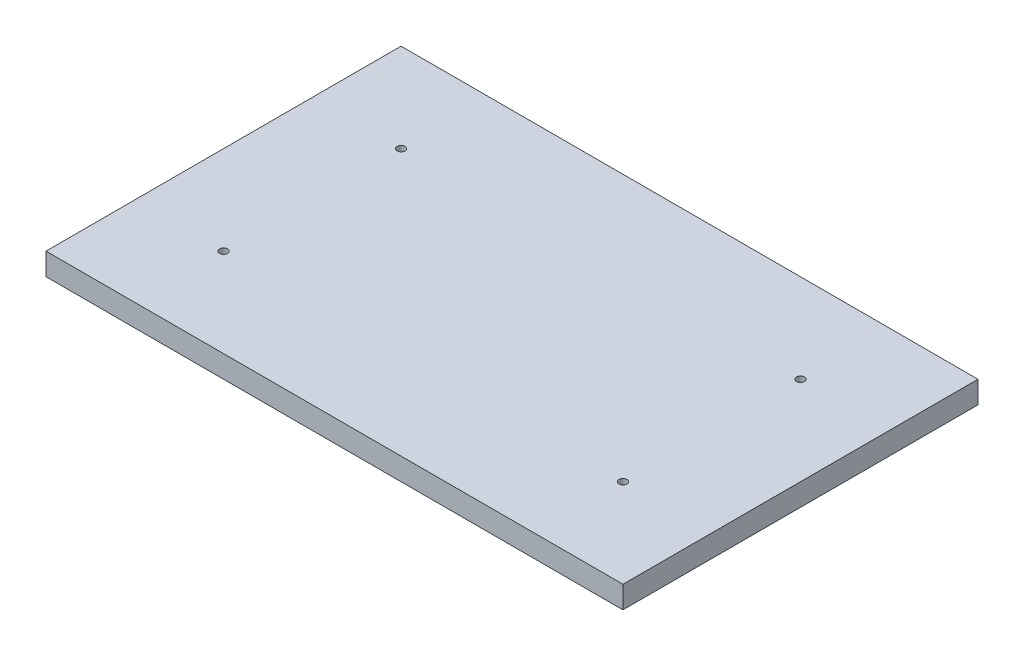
ISO-10303-21;
HEADER;
FILE_DESCRIPTION(('STEP AP214'),'2;1');
FILE_NAME('part.step','',(''),(''),'','','');
FILE_SCHEMA(('AUTOMOTIVE_DESIGN { 1 0 10303 214 1 1 1 1 }'));
ENDSEC;
DATA;
#1=APPLICATION_CONTEXT('core data for automotive mechanical design processes');
#2=APPLICATION_PROTOCOL_DEFINITION('international standard','automotive_design',2000,#1);
#3=PRODUCT_CONTEXT('',#1,'mechanical');
#4=PRODUCT('Part','Part','',(#3));
#5=PRODUCT_RELATED_PRODUCT_CATEGORY('part','',(#4));
#6=PRODUCT_DEFINITION_FORMATION('','',#4);
#7=PRODUCT_DEFINITION_CONTEXT('part definition',#1,'design');
#8=PRODUCT_DEFINITION('design','',#6,#7);
#9=PRODUCT_DEFINITION_SHAPE('','',#8);
#10=(LENGTH_UNIT() NAMED_UNIT(*) SI_UNIT(.MILLI.,.METRE.));
#11=(NAMED_UNIT(*) PLANE_ANGLE_UNIT() SI_UNIT($,.RADIAN.));
#12=(NAMED_UNIT(*) SI_UNIT($,.STERADIAN.) SOLID_ANGLE_UNIT());
#13=UNCERTAINTY_MEASURE_WITH_UNIT(LENGTH_MEASURE(1.E-05),#10,'distance_accuracy_value','');
#14=(GEOMETRIC_REPRESENTATION_CONTEXT(3) GLOBAL_UNCERTAINTY_ASSIGNED_CONTEXT((#13)) GLOBAL_UNIT_ASSIGNED_CONTEXT((#10,
#11,#12)) REPRESENTATION_CONTEXT('',''));
#15=CARTESIAN_POINT('',(0.,0.,0.));
#16=DIRECTION('',(0.,0.,1.));
#17=DIRECTION('',(1.,0.,0.));
#18=AXIS2_PLACEMENT_3D('',#15,#16,#17);
#19=CARTESIAN_POINT('',(-111.481894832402,6.35,-55.2508533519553));
#20=DIRECTION('',(1.,0.,0.));
#21=DIRECTION('',(0.,0.,-1.));
#22=AXIS2_PLACEMENT_3D('',#19,#20,#21);
#23=PLANE('',#22);
#24=DIRECTION('',(0.,0.,1.));
#25=VECTOR('',#24,1.);
#26=CARTESIAN_POINT('',(-111.481894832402,0.,-55.2508533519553));
#27=LINE('',#26,#25);
#28=CARTESIAN_POINT('',(-111.481894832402,0.,-55.2508533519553));
#29=VERTEX_POINT('',#28);
#30=CARTESIAN_POINT('',(-111.481894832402,0.,46.3491466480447));
#31=VERTEX_POINT('',#30);
#32=EDGE_CURVE('E98',#29,#31,#27,.T.);
#33=ORIENTED_EDGE('',*,*,#32,.T.);
#34=DIRECTION('',(0.,-1.,0.));
#35=VECTOR('',#34,1.);
#36=CARTESIAN_POINT('',(-111.481894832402,6.35,46.3491466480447));
#37=LINE('',#36,#35);
#38=CARTESIAN_POINT('',(-111.481894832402,6.35,46.3491466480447));
#39=VERTEX_POINT('',#38);
#40=EDGE_CURVE('E11',#39,#31,#37,.T.);
#41=ORIENTED_EDGE('',*,*,#40,.F.);
#42=DIRECTION('',(0.,0.,1.));
#43=VECTOR('',#42,1.);
#44=CARTESIAN_POINT('',(-111.481894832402,6.35,-55.2508533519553));
#45=LINE('',#44,#43);
#46=CARTESIAN_POINT('',(-111.481894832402,6.35,-55.2508533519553));
#47=VERTEX_POINT('',#46);
#48=EDGE_CURVE('E85',#47,#39,#45,.T.);
#49=ORIENTED_EDGE('',*,*,#48,.F.);
#50=DIRECTION('',(0.,-1.,0.));
#51=VECTOR('',#50,1.);
#52=CARTESIAN_POINT('',(-111.481894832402,6.35,-55.2508533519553));
#53=LINE('',#52,#51);
#54=EDGE_CURVE('E94',#47,#29,#53,.T.);
#55=ORIENTED_EDGE('',*,*,#54,.T.);
#56=EDGE_LOOP('',(#33,#41,#49,#55));
#57=FACE_BOUND('',#56,.T.);
#58=ADVANCED_FACE('F32',(#57),#23,.F.);
#59=CARTESIAN_POINT('',(-111.481894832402,6.35,46.3491466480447));
#60=DIRECTION('',(0.,0.,-1.));
#61=DIRECTION('',(-1.,0.,0.));
#62=AXIS2_PLACEMENT_3D('',#59,#60,#61);
#63=PLANE('',#62);
#64=DIRECTION('',(1.,0.,0.));
#65=VECTOR('',#64,1.);
#66=CARTESIAN_POINT('',(-111.481894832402,0.,46.3491466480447));
#67=LINE('',#66,#65);
#68=CARTESIAN_POINT('',(53.6181051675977,0.,46.3491466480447));
#69=VERTEX_POINT('',#68);
#70=EDGE_CURVE('E89',#31,#69,#67,.T.);
#71=ORIENTED_EDGE('',*,*,#70,.T.);
#72=DIRECTION('',(0.,-1.,0.));
#73=VECTOR('',#72,1.);
#74=CARTESIAN_POINT('',(53.6181051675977,6.35,46.3491466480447));
#75=LINE('',#74,#73);
#76=CARTESIAN_POINT('',(53.6181051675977,6.35,46.3491466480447));
#77=VERTEX_POINT('',#76);
#78=EDGE_CURVE('E41',#77,#69,#75,.T.);
#79=ORIENTED_EDGE('',*,*,#78,.F.);
#80=DIRECTION('',(1.,0.,0.));
#81=VECTOR('',#80,1.);
#82=CARTESIAN_POINT('',(-111.481894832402,6.35,46.3491466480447));
#83=LINE('',#82,#81);
#84=EDGE_CURVE('E80',#39,#77,#83,.T.);
#85=ORIENTED_EDGE('',*,*,#84,.F.);
#86=ORIENTED_EDGE('',*,*,#40,.T.);
#87=EDGE_LOOP('',(#71,#79,#85,#86));
#88=FACE_BOUND('',#87,.T.);
#89=ADVANCED_FACE('F88',(#88),#63,.F.);
#90=CARTESIAN_POINT('',(53.6181051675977,6.35,-55.2508533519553));
#91=DIRECTION('',(-1.,0.,0.));
#92=DIRECTION('',(0.,0.,1.));
#93=AXIS2_PLACEMENT_3D('',#90,#91,#92);
#94=PLANE('',#93);
#95=DIRECTION('',(0.,0.,-1.));
#96=VECTOR('',#95,1.);
#97=CARTESIAN_POINT('',(53.6181051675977,0.,-55.2508533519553));
#98=LINE('',#97,#96);
#99=CARTESIAN_POINT('',(53.6181051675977,0.,-55.2508533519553));
#100=VERTEX_POINT('',#99);
#101=EDGE_CURVE('E67',#69,#100,#98,.T.);
#102=ORIENTED_EDGE('',*,*,#101,.T.);
#103=DIRECTION('',(0.,-1.,0.));
#104=VECTOR('',#103,1.);
#105=CARTESIAN_POINT('',(53.6181051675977,6.35,-55.2508533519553));
#106=LINE('',#105,#104);
#107=CARTESIAN_POINT('',(53.6181051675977,6.35,-55.2508533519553));
#108=VERTEX_POINT('',#107);
#109=EDGE_CURVE('E90',#108,#100,#106,.T.);
#110=ORIENTED_EDGE('',*,*,#109,.F.);
#111=DIRECTION('',(0.,0.,-1.));
#112=VECTOR('',#111,1.);
#113=CARTESIAN_POINT('',(53.6181051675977,6.35,-55.2508533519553));
#114=LINE('',#113,#112);
#115=EDGE_CURVE('E83',#77,#108,#114,.T.);
#116=ORIENTED_EDGE('',*,*,#115,.F.);
#117=ORIENTED_EDGE('',*,*,#78,.T.);
#118=EDGE_LOOP('',(#102,#110,#116,#117));
#119=FACE_BOUND('',#118,.T.);
#120=ADVANCED_FACE('F92',(#119),#94,.F.);
#121=CARTESIAN_POINT('',(-111.481894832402,6.35,-55.2508533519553));
#122=DIRECTION('',(0.,0.,1.));
#123=DIRECTION('',(1.,0.,0.));
#124=AXIS2_PLACEMENT_3D('',#121,#122,#123);
#125=PLANE('',#124);
#126=DIRECTION('',(-1.,0.,0.));
#127=VECTOR('',#126,1.);
#128=CARTESIAN_POINT('',(-111.481894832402,0.,-55.2508533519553));
#129=LINE('',#128,#127);
#130=EDGE_CURVE('E73',#100,#29,#129,.T.);
#131=ORIENTED_EDGE('',*,*,#130,.T.);
#132=ORIENTED_EDGE('',*,*,#54,.F.);
#133=DIRECTION('',(-1.,0.,0.));
#134=VECTOR('',#133,1.);
#135=CARTESIAN_POINT('',(-111.481894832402,6.35,-55.2508533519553));
#136=LINE('',#135,#134);
#137=EDGE_CURVE('E50',#108,#47,#136,.T.);
#138=ORIENTED_EDGE('',*,*,#137,.F.);
#139=ORIENTED_EDGE('',*,*,#109,.T.);
#140=EDGE_LOOP('',(#131,#132,#138,#139));
#141=FACE_BOUND('',#140,.T.);
#142=ADVANCED_FACE('F136',(#141),#125,.F.);
#143=CARTESIAN_POINT('',(-111.481894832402,6.35,46.3491466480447));
#144=DIRECTION('',(0.,1.,0.));
#145=DIRECTION('',(0.,0.,1.));
#146=AXIS2_PLACEMENT_3D('',#143,#144,#145);
#147=PLANE('',#146);
#148=CARTESIAN_POINT('',(-86.0818948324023,6.35,20.9491466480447));
#149=DIRECTION('',(0.,1.,0.));
#150=DIRECTION('',(0.,0.,1.));
#151=AXIS2_PLACEMENT_3D('',#148,#149,#150);
#152=CIRCLE('',#151,1.13029999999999);
#153=CARTESIAN_POINT('',(-86.0818948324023,6.35,22.0794466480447));
#154=VERTEX_POINT('',#153);
#155=EDGE_CURVE('E125',#154,#154,#152,.T.);
#156=ORIENTED_EDGE('',*,*,#155,.F.);
#157=EDGE_LOOP('',(#156));
#158=FACE_BOUND('',#157,.T.);
#159=CARTESIAN_POINT('',(-86.0818948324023,6.35,-29.8508533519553));
#160=DIRECTION('',(0.,1.,0.));
#161=DIRECTION('',(0.,0.,1.));
#162=AXIS2_PLACEMENT_3D('',#159,#160,#161);
#163=CIRCLE('',#162,1.13029999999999);
#164=CARTESIAN_POINT('',(-86.0818948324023,6.35,-28.7205533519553));
#165=VERTEX_POINT('',#164);
#166=EDGE_CURVE('E115',#165,#165,#163,.T.);
#167=ORIENTED_EDGE('',*,*,#166,.F.);
#168=EDGE_LOOP('',(#167));
#169=FACE_BOUND('',#168,.T.);
#170=CARTESIAN_POINT('',(28.2181051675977,6.35,-29.8508533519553));
#171=DIRECTION('',(0.,1.,0.));
#172=DIRECTION('',(0.,0.,1.));
#173=AXIS2_PLACEMENT_3D('',#170,#171,#172);
#174=CIRCLE('',#173,1.13029999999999);
#175=CARTESIAN_POINT('',(28.2181051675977,6.35,-28.7205533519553));
#176=VERTEX_POINT('',#175);
#177=EDGE_CURVE('E112',#176,#176,#174,.T.);
#178=ORIENTED_EDGE('',*,*,#177,.F.);
#179=EDGE_LOOP('',(#178));
#180=FACE_BOUND('',#179,.T.);
#181=CARTESIAN_POINT('',(28.2181051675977,6.35,20.9491466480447));
#182=DIRECTION('',(0.,1.,0.));
#183=DIRECTION('',(0.,0.,1.));
#184=AXIS2_PLACEMENT_3D('',#181,#182,#183);
#185=CIRCLE('',#184,1.13029999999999);
#186=CARTESIAN_POINT('',(28.2181051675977,6.35,22.0794466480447));
#187=VERTEX_POINT('',#186);
#188=EDGE_CURVE('E109',#187,#187,#185,.T.);
#189=ORIENTED_EDGE('',*,*,#188,.F.);
#190=EDGE_LOOP('',(#189));
#191=FACE_BOUND('',#190,.T.);
#192=ORIENTED_EDGE('',*,*,#48,.T.);
#193=ORIENTED_EDGE('',*,*,#84,.T.);
#194=ORIENTED_EDGE('',*,*,#115,.T.);
#195=ORIENTED_EDGE('',*,*,#137,.T.);
#196=EDGE_LOOP('',(#192,#193,#194,#195));
#197=FACE_BOUND('',#196,.T.);
#198=ADVANCED_FACE('F81',(#158,#169,#180,#191,#197),#147,.T.);
#199=CARTESIAN_POINT('',(-111.481894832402,0.,46.3491466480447));
#200=DIRECTION('',(0.,1.,0.));
#201=DIRECTION('',(0.,0.,1.));
#202=AXIS2_PLACEMENT_3D('',#199,#200,#201);
#203=PLANE('',#202);
#204=CARTESIAN_POINT('',(-86.0818948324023,0.,20.9491466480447));
#205=DIRECTION('',(0.,1.,0.));
#206=DIRECTION('',(0.,0.,1.));
#207=AXIS2_PLACEMENT_3D('',#204,#205,#206);
#208=CIRCLE('',#207,1.13029999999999);
#209=CARTESIAN_POINT('',(-86.0818948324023,0.,22.0794466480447));
#210=VERTEX_POINT('',#209);
#211=EDGE_CURVE('E35',#210,#210,#208,.T.);
#212=ORIENTED_EDGE('',*,*,#211,.T.);
#213=EDGE_LOOP('',(#212));
#214=FACE_BOUND('',#213,.T.);
#215=CARTESIAN_POINT('',(-86.0818948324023,0.,-29.8508533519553));
#216=DIRECTION('',(0.,1.,0.));
#217=DIRECTION('',(0.,0.,1.));
#218=AXIS2_PLACEMENT_3D('',#215,#216,#217);
#219=CIRCLE('',#218,1.13029999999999);
#220=CARTESIAN_POINT('',(-86.0818948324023,0.,-28.7205533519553));
#221=VERTEX_POINT('',#220);
#222=EDGE_CURVE('E113',#221,#221,#219,.T.);
#223=ORIENTED_EDGE('',*,*,#222,.T.);
#224=EDGE_LOOP('',(#223));
#225=FACE_BOUND('',#224,.T.);
#226=CARTESIAN_POINT('',(28.2181051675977,0.,-29.8508533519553));
#227=DIRECTION('',(0.,1.,0.));
#228=DIRECTION('',(0.,0.,1.));
#229=AXIS2_PLACEMENT_3D('',#226,#227,#228);
#230=CIRCLE('',#229,1.13029999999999);
#231=CARTESIAN_POINT('',(28.2181051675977,0.,-28.7205533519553));
#232=VERTEX_POINT('',#231);
#233=EDGE_CURVE('E110',#232,#232,#230,.T.);
#234=ORIENTED_EDGE('',*,*,#233,.T.);
#235=EDGE_LOOP('',(#234));
#236=FACE_BOUND('',#235,.T.);
#237=CARTESIAN_POINT('',(28.2181051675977,0.,20.9491466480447));
#238=DIRECTION('',(0.,1.,0.));
#239=DIRECTION('',(0.,0.,1.));
#240=AXIS2_PLACEMENT_3D('',#237,#238,#239);
#241=CIRCLE('',#240,1.13029999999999);
#242=CARTESIAN_POINT('',(28.2181051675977,0.,22.0794466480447));
#243=VERTEX_POINT('',#242);
#244=EDGE_CURVE('E101',#243,#243,#241,.T.);
#245=ORIENTED_EDGE('',*,*,#244,.T.);
#246=EDGE_LOOP('',(#245));
#247=FACE_BOUND('',#246,.T.);
#248=ORIENTED_EDGE('',*,*,#32,.F.);
#249=ORIENTED_EDGE('',*,*,#130,.F.);
#250=ORIENTED_EDGE('',*,*,#101,.F.);
#251=ORIENTED_EDGE('',*,*,#70,.F.);
#252=EDGE_LOOP('',(#248,#249,#250,#251));
#253=FACE_BOUND('',#252,.T.);
#254=ADVANCED_FACE('F135',(#214,#225,#236,#247,#253),#203,.F.);
#255=CARTESIAN_POINT('',(28.2181051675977,6.35,20.9491466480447));
#256=DIRECTION('',(0.,1.,0.));
#257=DIRECTION('',(0.,0.,1.));
#258=AXIS2_PLACEMENT_3D('',#255,#256,#257);
#259=CYLINDRICAL_SURFACE('',#258,1.13029999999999);
#260=ORIENTED_EDGE('',*,*,#188,.T.);
#261=EDGE_LOOP('',(#260));
#262=FACE_BOUND('',#261,.T.);
#263=ORIENTED_EDGE('',*,*,#244,.F.);
#264=EDGE_LOOP('',(#263));
#265=FACE_BOUND('',#264,.T.);
#266=ADVANCED_FACE('F131',(#262,#265),#259,.F.);
#267=CARTESIAN_POINT('',(28.2181051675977,6.35,-29.8508533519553));
#268=DIRECTION('',(0.,1.,0.));
#269=DIRECTION('',(0.,0.,1.));
#270=AXIS2_PLACEMENT_3D('',#267,#268,#269);
#271=CYLINDRICAL_SURFACE('',#270,1.13029999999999);
#272=ORIENTED_EDGE('',*,*,#177,.T.);
#273=EDGE_LOOP('',(#272));
#274=FACE_BOUND('',#273,.T.);
#275=ORIENTED_EDGE('',*,*,#233,.F.);
#276=EDGE_LOOP('',(#275));
#277=FACE_BOUND('',#276,.T.);
#278=ADVANCED_FACE('F186',(#274,#277),#271,.F.);
#279=CARTESIAN_POINT('',(-86.0818948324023,6.35,-29.8508533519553));
#280=DIRECTION('',(0.,1.,0.));
#281=DIRECTION('',(0.,0.,1.));
#282=AXIS2_PLACEMENT_3D('',#279,#280,#281);
#283=CYLINDRICAL_SURFACE('',#282,1.13029999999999);
#284=ORIENTED_EDGE('',*,*,#166,.T.);
#285=EDGE_LOOP('',(#284));
#286=FACE_BOUND('',#285,.T.);
#287=ORIENTED_EDGE('',*,*,#222,.F.);
#288=EDGE_LOOP('',(#287));
#289=FACE_BOUND('',#288,.T.);
#290=ADVANCED_FACE('F195',(#286,#289),#283,.F.);
#291=CARTESIAN_POINT('',(-86.0818948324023,6.35,20.9491466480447));
#292=DIRECTION('',(0.,1.,0.));
#293=DIRECTION('',(0.,0.,1.));
#294=AXIS2_PLACEMENT_3D('',#291,#292,#293);
#295=CYLINDRICAL_SURFACE('',#294,1.13029999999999);
#296=ORIENTED_EDGE('',*,*,#155,.T.);
#297=EDGE_LOOP('',(#296));
#298=FACE_BOUND('',#297,.T.);
#299=ORIENTED_EDGE('',*,*,#211,.F.);
#300=EDGE_LOOP('',(#299));
#301=FACE_BOUND('',#300,.T.);
#302=ADVANCED_FACE('F206',(#298,#301),#295,.F.);
#303=CLOSED_SHELL('',(#58,#89,#120,#142,#198,#254,#266,#278,#290,#302));
#304=MANIFOLD_SOLID_BREP('B2',#303);
#305=ADVANCED_BREP_SHAPE_REPRESENTATION('',(#18,#304),#14);
#306=SHAPE_DEFINITION_REPRESENTATION(#9,#305);
ENDSEC;
END-ISO-10303-21;
